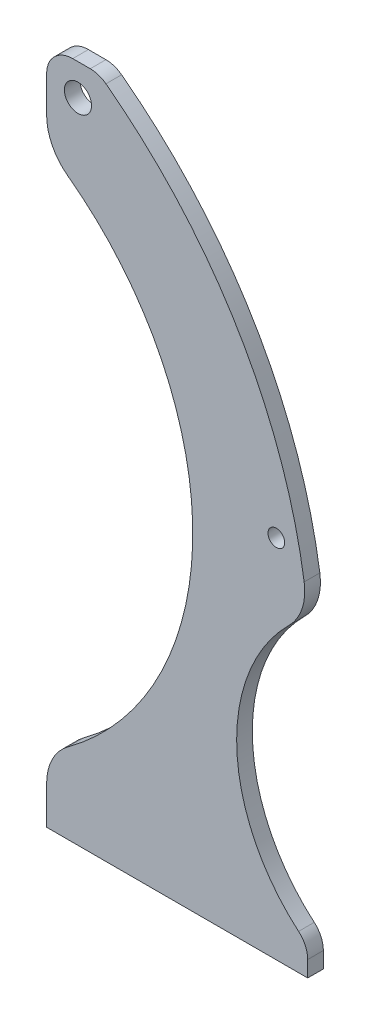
ISO-10303-21;
HEADER;
FILE_DESCRIPTION(('STEP AP214'),'2;1');
FILE_NAME('part.step','',(''),(''),'','','');
FILE_SCHEMA(('AUTOMOTIVE_DESIGN { 1 0 10303 214 1 1 1 1 }'));
ENDSEC;
DATA;
#1=APPLICATION_CONTEXT('core data for automotive mechanical design processes');
#2=APPLICATION_PROTOCOL_DEFINITION('international standard','automotive_design',2000,#1);
#3=PRODUCT_CONTEXT('',#1,'mechanical');
#4=PRODUCT('Part','Part','',(#3));
#5=PRODUCT_RELATED_PRODUCT_CATEGORY('part','',(#4));
#6=PRODUCT_DEFINITION_FORMATION('','',#4);
#7=PRODUCT_DEFINITION_CONTEXT('part definition',#1,'design');
#8=PRODUCT_DEFINITION('design','',#6,#7);
#9=PRODUCT_DEFINITION_SHAPE('','',#8);
#10=(LENGTH_UNIT() NAMED_UNIT(*) SI_UNIT(.MILLI.,.METRE.));
#11=(NAMED_UNIT(*) PLANE_ANGLE_UNIT() SI_UNIT($,.RADIAN.));
#12=(NAMED_UNIT(*) SI_UNIT($,.STERADIAN.) SOLID_ANGLE_UNIT());
#13=UNCERTAINTY_MEASURE_WITH_UNIT(LENGTH_MEASURE(1.E-05),#10,'distance_accuracy_value','');
#14=(GEOMETRIC_REPRESENTATION_CONTEXT(3) GLOBAL_UNCERTAINTY_ASSIGNED_CONTEXT((#13)) GLOBAL_UNIT_ASSIGNED_CONTEXT((#10,
#11,#12)) REPRESENTATION_CONTEXT('',''));
#15=CARTESIAN_POINT('',(0.,0.,0.));
#16=DIRECTION('',(0.,0.,1.));
#17=DIRECTION('',(1.,0.,0.));
#18=AXIS2_PLACEMENT_3D('',#15,#16,#17);
#19=CARTESIAN_POINT('',(22.062235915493,53.975,3.));
#20=DIRECTION('',(-1.,0.,0.));
#21=DIRECTION('',(0.,-1.,0.));
#22=AXIS2_PLACEMENT_3D('',#19,#20,#21);
#23=PLANE('',#22);
#24=DIRECTION('',(0.,1.,0.));
#25=VECTOR('',#24,1.);
#26=CARTESIAN_POINT('',(22.062235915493,53.975,0.));
#27=LINE('',#26,#25);
#28=CARTESIAN_POINT('',(22.062235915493,-76.025,0.));
#29=VERTEX_POINT('',#28);
#30=CARTESIAN_POINT('',(22.062235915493,-72.9630040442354,0.));
#31=VERTEX_POINT('',#30);
#32=EDGE_CURVE('E148',#29,#31,#27,.T.);
#33=ORIENTED_EDGE('',*,*,#32,.T.);
#34=DIRECTION('',(0.,0.,1.));
#35=VECTOR('',#34,1.);
#36=CARTESIAN_POINT('',(22.062235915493,-72.9630040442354,3.));
#37=LINE('',#36,#35);
#38=CARTESIAN_POINT('',(22.062235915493,-72.9630040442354,3.));
#39=VERTEX_POINT('',#38);
#40=EDGE_CURVE('E205',#31,#39,#37,.T.);
#41=ORIENTED_EDGE('',*,*,#40,.T.);
#42=DIRECTION('',(0.,1.,0.));
#43=VECTOR('',#42,1.);
#44=CARTESIAN_POINT('',(22.062235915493,53.975,3.));
#45=LINE('',#44,#43);
#46=CARTESIAN_POINT('',(22.062235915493,-76.025,3.));
#47=VERTEX_POINT('',#46);
#48=EDGE_CURVE('E262',#47,#39,#45,.T.);
#49=ORIENTED_EDGE('',*,*,#48,.F.);
#50=DIRECTION('',(0.,0.,-1.));
#51=VECTOR('',#50,1.);
#52=CARTESIAN_POINT('',(22.062235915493,-76.025,3.));
#53=LINE('',#52,#51);
#54=EDGE_CURVE('E157',#47,#29,#53,.T.);
#55=ORIENTED_EDGE('',*,*,#54,.T.);
#56=EDGE_LOOP('',(#33,#41,#49,#55));
#57=FACE_BOUND('',#56,.T.);
#58=ADVANCED_FACE('F31',(#57),#23,.F.);
#59=CARTESIAN_POINT('',(-27.937764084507,53.975,3.));
#60=DIRECTION('',(1.,0.,0.));
#61=DIRECTION('',(0.,1.,0.));
#62=AXIS2_PLACEMENT_3D('',#59,#60,#61);
#63=PLANE('',#62);
#64=DIRECTION('',(0.,-1.,0.));
#65=VECTOR('',#64,1.);
#66=CARTESIAN_POINT('',(-27.937764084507,53.975,3.));
#67=LINE('',#66,#65);
#68=CARTESIAN_POINT('',(-27.937764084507,48.975,3.));
#69=VERTEX_POINT('',#68);
#70=CARTESIAN_POINT('',(-27.937764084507,42.0916572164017,3.));
#71=VERTEX_POINT('',#70);
#72=EDGE_CURVE('E259',#69,#71,#67,.T.);
#73=ORIENTED_EDGE('',*,*,#72,.F.);
#74=DIRECTION('',(0.,0.,-1.));
#75=VECTOR('',#74,1.);
#76=CARTESIAN_POINT('',(-27.937764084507,48.975,3.));
#77=LINE('',#76,#75);
#78=CARTESIAN_POINT('',(-27.937764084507,48.975,0.));
#79=VERTEX_POINT('',#78);
#80=EDGE_CURVE('E11',#69,#79,#77,.T.);
#81=ORIENTED_EDGE('',*,*,#80,.T.);
#82=DIRECTION('',(0.,-1.,0.));
#83=VECTOR('',#82,1.);
#84=CARTESIAN_POINT('',(-27.937764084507,53.975,0.));
#85=LINE('',#84,#83);
#86=CARTESIAN_POINT('',(-27.937764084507,42.0916572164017,0.));
#87=VERTEX_POINT('',#86);
#88=EDGE_CURVE('E140',#79,#87,#85,.T.);
#89=ORIENTED_EDGE('',*,*,#88,.T.);
#90=DIRECTION('',(0.,0.,1.));
#91=VECTOR('',#90,1.);
#92=CARTESIAN_POINT('',(-27.937764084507,42.0916572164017,3.));
#93=LINE('',#92,#91);
#94=EDGE_CURVE('E196',#87,#71,#93,.T.);
#95=ORIENTED_EDGE('',*,*,#94,.T.);
#96=EDGE_LOOP('',(#73,#81,#89,#95));
#97=FACE_BOUND('',#96,.T.);
#98=ADVANCED_FACE('F269',(#97),#63,.F.);
#99=CARTESIAN_POINT('',(-27.937764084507,-68.7140359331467,3.));
#100=VERTEX_POINT('',#99);
#101=CARTESIAN_POINT('',(-27.937764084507,-76.025,3.));
#102=VERTEX_POINT('',#101);
#103=EDGE_CURVE('E232',#100,#102,#67,.T.);
#104=ORIENTED_EDGE('',*,*,#103,.F.);
#105=DIRECTION('',(0.,0.,1.));
#106=VECTOR('',#105,1.);
#107=CARTESIAN_POINT('',(-27.937764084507,-68.7140359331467,3.));
#108=LINE('',#107,#106);
#109=CARTESIAN_POINT('',(-27.937764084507,-68.7140359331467,0.));
#110=VERTEX_POINT('',#109);
#111=EDGE_CURVE('E138',#100,#110,#108,.F.);
#112=ORIENTED_EDGE('',*,*,#111,.T.);
#113=CARTESIAN_POINT('',(-27.937764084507,-76.025,0.));
#114=VERTEX_POINT('',#113);
#115=EDGE_CURVE('E132',#110,#114,#85,.T.);
#116=ORIENTED_EDGE('',*,*,#115,.T.);
#117=DIRECTION('',(0.,0.,-1.));
#118=VECTOR('',#117,1.);
#119=CARTESIAN_POINT('',(-27.937764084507,-76.025,3.));
#120=LINE('',#119,#118);
#121=EDGE_CURVE('E136',#102,#114,#120,.T.);
#122=ORIENTED_EDGE('',*,*,#121,.F.);
#123=EDGE_LOOP('',(#104,#112,#116,#122));
#124=FACE_BOUND('',#123,.T.);
#125=ADVANCED_FACE('F33',(#124),#63,.F.);
#126=CARTESIAN_POINT('',(-27.937764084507,-76.025,3.));
#127=DIRECTION('',(0.,1.,0.));
#128=DIRECTION('',(0.,0.,1.));
#129=AXIS2_PLACEMENT_3D('',#126,#127,#128);
#130=PLANE('',#129);
#131=DIRECTION('',(1.,0.,0.));
#132=VECTOR('',#131,1.);
#133=CARTESIAN_POINT('',(-27.937764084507,-76.025,0.));
#134=LINE('',#133,#132);
#135=EDGE_CURVE('E144',#114,#29,#134,.T.);
#136=ORIENTED_EDGE('',*,*,#135,.T.);
#137=ORIENTED_EDGE('',*,*,#54,.F.);
#138=DIRECTION('',(1.,0.,0.));
#139=VECTOR('',#138,1.);
#140=CARTESIAN_POINT('',(-27.937764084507,-76.025,3.));
#141=LINE('',#140,#139);
#142=EDGE_CURVE('E155',#102,#47,#141,.T.);
#143=ORIENTED_EDGE('',*,*,#142,.F.);
#144=ORIENTED_EDGE('',*,*,#121,.T.);
#145=EDGE_LOOP('',(#136,#137,#143,#144));
#146=FACE_BOUND('',#145,.T.);
#147=ADVANCED_FACE('F154',(#146),#130,.F.);
#148=CARTESIAN_POINT('',(-27.937764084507,53.975,3.));
#149=DIRECTION('',(0.,-1.,0.));
#150=DIRECTION('',(0.,0.,-1.));
#151=AXIS2_PLACEMENT_3D('',#148,#149,#150);
#152=PLANE('',#151);
#153=DIRECTION('',(-1.,0.,0.));
#154=VECTOR('',#153,1.);
#155=CARTESIAN_POINT('',(-27.937764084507,53.975,3.));
#156=LINE('',#155,#154);
#157=CARTESIAN_POINT('',(-19.5825176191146,53.975,3.));
#158=VERTEX_POINT('',#157);
#159=CARTESIAN_POINT('',(-22.937764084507,53.975,3.));
#160=VERTEX_POINT('',#159);
#161=EDGE_CURVE('E162',#158,#160,#156,.T.);
#162=ORIENTED_EDGE('',*,*,#161,.F.);
#163=DIRECTION('',(0.,0.,1.));
#164=VECTOR('',#163,1.);
#165=CARTESIAN_POINT('',(-19.5825176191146,53.975,3.));
#166=LINE('',#165,#164);
#167=CARTESIAN_POINT('',(-19.5825176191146,53.975,0.));
#168=VERTEX_POINT('',#167);
#169=EDGE_CURVE('E39',#158,#168,#166,.F.);
#170=ORIENTED_EDGE('',*,*,#169,.T.);
#171=DIRECTION('',(-1.,0.,0.));
#172=VECTOR('',#171,1.);
#173=CARTESIAN_POINT('',(-27.937764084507,53.975,0.));
#174=LINE('',#173,#172);
#175=CARTESIAN_POINT('',(-22.937764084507,53.975,0.));
#176=VERTEX_POINT('',#175);
#177=EDGE_CURVE('E228',#168,#176,#174,.T.);
#178=ORIENTED_EDGE('',*,*,#177,.T.);
#179=DIRECTION('',(0.,0.,-1.));
#180=VECTOR('',#179,1.);
#181=CARTESIAN_POINT('',(-22.937764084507,53.975,3.));
#182=LINE('',#181,#180);
#183=EDGE_CURVE('E223',#176,#160,#182,.F.);
#184=ORIENTED_EDGE('',*,*,#183,.T.);
#185=EDGE_LOOP('',(#162,#170,#178,#184));
#186=FACE_BOUND('',#185,.T.);
#187=ADVANCED_FACE('F227',(#186),#152,.F.);
#188=CARTESIAN_POINT('',(-27.937764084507,-76.025,3.));
#189=DIRECTION('',(0.,0.,1.));
#190=DIRECTION('',(1.,0.,0.));
#191=AXIS2_PLACEMENT_3D('',#188,#189,#190);
#192=PLANE('',#191);
#193=ORIENTED_EDGE('',*,*,#48,.T.);
#194=CARTESIAN_POINT('',(17.062235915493,-72.9630040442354,3.));
#195=DIRECTION('',(0.,0.,1.));
#196=DIRECTION('',(1.,0.,0.));
#197=AXIS2_PLACEMENT_3D('',#194,#195,#196);
#198=CIRCLE('',#197,5.);
#199=CARTESIAN_POINT('',(20.3144978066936,-69.1652688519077,3.));
#200=VERTEX_POINT('',#199);
#201=EDGE_CURVE('E212',#39,#200,#198,.T.);
#202=ORIENTED_EDGE('',*,*,#201,.T.);
#203=CARTESIAN_POINT('',(42.3826716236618,-43.3957942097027,3.));
#204=DIRECTION('',(0.,0.,1.));
#205=DIRECTION('',(1.,0.,0.));
#206=AXIS2_PLACEMENT_3D('',#203,#204,#205);
#207=CIRCLE('',#206,33.927424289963);
#208=CARTESIAN_POINT('',(18.5298926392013,-19.2687335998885,3.));
#209=VERTEX_POINT('',#208);
#210=EDGE_CURVE('E246',#209,#200,#207,.T.);
#211=ORIENTED_EDGE('',*,*,#210,.F.);
#212=CARTESIAN_POINT('',(11.499362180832,-12.1573595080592,3.));
#213=DIRECTION('',(0.,0.,1.));
#214=DIRECTION('',(1.,0.,0.));
#215=AXIS2_PLACEMENT_3D('',#212,#213,#214);
#216=CIRCLE('',#215,10.);
#217=CARTESIAN_POINT('',(21.3880484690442,-10.6694470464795,3.));
#218=VERTEX_POINT('',#217);
#219=EDGE_CURVE('E181',#209,#218,#216,.T.);
#220=ORIENTED_EDGE('',*,*,#219,.T.);
#221=CARTESIAN_POINT('',(-75.3284238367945,-25.2220013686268,3.));
#222=DIRECTION('',(0.,0.,-1.));
#223=DIRECTION('',(-1.,0.,0.));
#224=AXIS2_PLACEMENT_3D('',#221,#222,#223);
#225=CIRCLE('',#224,97.8051780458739);
#226=CARTESIAN_POINT('',(-16.5791342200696,52.9724602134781,3.));
#227=VERTEX_POINT('',#226);
#228=EDGE_CURVE('E239',#227,#218,#225,.T.);
#229=ORIENTED_EDGE('',*,*,#228,.F.);
#230=CARTESIAN_POINT('',(-19.5825176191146,48.975,3.));
#231=DIRECTION('',(0.,0.,1.));
#232=DIRECTION('',(1.,0.,0.));
#233=AXIS2_PLACEMENT_3D('',#230,#231,#232);
#234=CIRCLE('',#233,5.);
#235=EDGE_CURVE('E210',#227,#158,#234,.T.);
#236=ORIENTED_EDGE('',*,*,#235,.T.);
#237=ORIENTED_EDGE('',*,*,#161,.T.);
#238=CARTESIAN_POINT('',(-22.937764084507,48.975,3.));
#239=DIRECTION('',(0.,0.,1.));
#240=DIRECTION('',(1.,0.,0.));
#241=AXIS2_PLACEMENT_3D('',#238,#239,#240);
#242=CIRCLE('',#241,5.);
#243=EDGE_CURVE('E208',#160,#69,#242,.T.);
#244=ORIENTED_EDGE('',*,*,#243,.T.);
#245=ORIENTED_EDGE('',*,*,#72,.T.);
#246=CARTESIAN_POINT('',(-17.937764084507,42.0916572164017,3.));
#247=DIRECTION('',(0.,0.,1.));
#248=DIRECTION('',(1.,0.,0.));
#249=AXIS2_PLACEMENT_3D('',#246,#247,#248);
#250=CIRCLE('',#249,10.);
#251=CARTESIAN_POINT('',(-23.8712225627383,34.0421808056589,3.));
#252=VERTEX_POINT('',#251);
#253=EDGE_CURVE('E184',#71,#252,#250,.T.);
#254=ORIENTED_EDGE('',*,*,#253,.T.);
#255=CARTESIAN_POINT('',(-58.7765060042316,-13.3111893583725,3.));
#256=DIRECTION('',(0.,0.,1.));
#257=DIRECTION('',(1.,0.,0.));
#258=AXIS2_PLACEMENT_3D('',#255,#256,#257);
#259=CIRCLE('',#258,58.8278886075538);
#260=CARTESIAN_POINT('',(-23.8712225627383,-60.6645595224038,3.));
#261=VERTEX_POINT('',#260);
#262=EDGE_CURVE('E249',#261,#252,#259,.T.);
#263=ORIENTED_EDGE('',*,*,#262,.F.);
#264=CARTESIAN_POINT('',(-17.937764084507,-68.7140359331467,3.));
#265=DIRECTION('',(0.,0.,1.));
#266=DIRECTION('',(1.,0.,0.));
#267=AXIS2_PLACEMENT_3D('',#264,#265,#266);
#268=CIRCLE('',#267,10.);
#269=EDGE_CURVE('E186',#261,#100,#268,.T.);
#270=ORIENTED_EDGE('',*,*,#269,.T.);
#271=ORIENTED_EDGE('',*,*,#103,.T.);
#272=ORIENTED_EDGE('',*,*,#142,.T.);
#273=EDGE_LOOP('',(#193,#202,#211,#220,#229,#236,#237,#244,#245,#254,#263,#270,#271,#272));
#274=FACE_BOUND('',#273,.T.);
#275=CARTESIAN_POINT('',(16.062235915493,-6.025,3.));
#276=DIRECTION('',(0.,0.,1.));
#277=DIRECTION('',(1.,0.,0.));
#278=AXIS2_PLACEMENT_3D('',#275,#276,#277);
#279=CIRCLE('',#278,1.6);
#280=CARTESIAN_POINT('',(17.662235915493,-6.025,3.));
#281=VERTEX_POINT('',#280);
#282=EDGE_CURVE('E171',#281,#281,#279,.T.);
#283=ORIENTED_EDGE('',*,*,#282,.F.);
#284=EDGE_LOOP('',(#283));
#285=FACE_BOUND('',#284,.T.);
#286=CARTESIAN_POINT('',(-21.937764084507,47.975,3.));
#287=DIRECTION('',(0.,0.,1.));
#288=DIRECTION('',(1.,0.,0.));
#289=AXIS2_PLACEMENT_3D('',#286,#287,#288);
#290=CIRCLE('',#289,2.6);
#291=CARTESIAN_POINT('',(-19.337764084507,47.975,3.));
#292=VERTEX_POINT('',#291);
#293=EDGE_CURVE('E168',#292,#292,#290,.T.);
#294=ORIENTED_EDGE('',*,*,#293,.F.);
#295=EDGE_LOOP('',(#294));
#296=FACE_BOUND('',#295,.T.);
#297=ADVANCED_FACE('F242',(#274,#285,#296),#192,.T.);
#298=CARTESIAN_POINT('',(-27.937764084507,-76.025,0.));
#299=DIRECTION('',(0.,0.,1.));
#300=DIRECTION('',(1.,0.,0.));
#301=AXIS2_PLACEMENT_3D('',#298,#299,#300);
#302=PLANE('',#301);
#303=CARTESIAN_POINT('',(16.062235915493,-6.025,0.));
#304=DIRECTION('',(0.,0.,1.));
#305=DIRECTION('',(1.,0.,0.));
#306=AXIS2_PLACEMENT_3D('',#303,#304,#305);
#307=CIRCLE('',#306,1.6);
#308=CARTESIAN_POINT('',(17.662235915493,-6.025,0.));
#309=VERTEX_POINT('',#308);
#310=EDGE_CURVE('E169',#309,#309,#307,.T.);
#311=ORIENTED_EDGE('',*,*,#310,.T.);
#312=EDGE_LOOP('',(#311));
#313=FACE_BOUND('',#312,.T.);
#314=CARTESIAN_POINT('',(-21.937764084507,47.975,0.));
#315=DIRECTION('',(0.,0.,1.));
#316=DIRECTION('',(1.,0.,0.));
#317=AXIS2_PLACEMENT_3D('',#314,#315,#316);
#318=CIRCLE('',#317,2.6);
#319=CARTESIAN_POINT('',(-19.337764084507,47.975,0.));
#320=VERTEX_POINT('',#319);
#321=EDGE_CURVE('E141',#320,#320,#318,.T.);
#322=ORIENTED_EDGE('',*,*,#321,.T.);
#323=EDGE_LOOP('',(#322));
#324=FACE_BOUND('',#323,.T.);
#325=CARTESIAN_POINT('',(42.3826716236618,-43.3957942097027,0.));
#326=DIRECTION('',(0.,0.,1.));
#327=DIRECTION('',(1.,0.,0.));
#328=AXIS2_PLACEMENT_3D('',#325,#326,#327);
#329=CIRCLE('',#328,33.927424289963);
#330=CARTESIAN_POINT('',(18.5298926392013,-19.2687335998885,0.));
#331=VERTEX_POINT('',#330);
#332=CARTESIAN_POINT('',(20.3144978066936,-69.1652688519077,0.));
#333=VERTEX_POINT('',#332);
#334=EDGE_CURVE('E160',#331,#333,#329,.T.);
#335=ORIENTED_EDGE('',*,*,#334,.T.);
#336=CARTESIAN_POINT('',(17.062235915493,-72.9630040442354,0.));
#337=DIRECTION('',(0.,0.,1.));
#338=DIRECTION('',(1.,0.,0.));
#339=AXIS2_PLACEMENT_3D('',#336,#337,#338);
#340=CIRCLE('',#339,5.);
#341=EDGE_CURVE('E218',#333,#31,#340,.F.);
#342=ORIENTED_EDGE('',*,*,#341,.T.);
#343=ORIENTED_EDGE('',*,*,#32,.F.);
#344=ORIENTED_EDGE('',*,*,#135,.F.);
#345=ORIENTED_EDGE('',*,*,#115,.F.);
#346=CARTESIAN_POINT('',(-17.937764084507,-68.7140359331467,0.));
#347=DIRECTION('',(0.,0.,1.));
#348=DIRECTION('',(1.,0.,0.));
#349=AXIS2_PLACEMENT_3D('',#346,#347,#348);
#350=CIRCLE('',#349,10.);
#351=CARTESIAN_POINT('',(-23.8712225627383,-60.6645595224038,0.));
#352=VERTEX_POINT('',#351);
#353=EDGE_CURVE('E194',#110,#352,#350,.F.);
#354=ORIENTED_EDGE('',*,*,#353,.T.);
#355=CARTESIAN_POINT('',(-58.7765060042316,-13.3111893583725,0.));
#356=DIRECTION('',(0.,0.,1.));
#357=DIRECTION('',(1.,0.,0.));
#358=AXIS2_PLACEMENT_3D('',#355,#356,#357);
#359=CIRCLE('',#358,58.8278886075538);
#360=CARTESIAN_POINT('',(-23.8712225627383,34.0421808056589,0.));
#361=VERTEX_POINT('',#360);
#362=EDGE_CURVE('E156',#352,#361,#359,.T.);
#363=ORIENTED_EDGE('',*,*,#362,.T.);
#364=CARTESIAN_POINT('',(-17.937764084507,42.0916572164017,0.));
#365=DIRECTION('',(0.,0.,1.));
#366=DIRECTION('',(1.,0.,0.));
#367=AXIS2_PLACEMENT_3D('',#364,#365,#366);
#368=CIRCLE('',#367,10.);
#369=EDGE_CURVE('E191',#361,#87,#368,.F.);
#370=ORIENTED_EDGE('',*,*,#369,.T.);
#371=ORIENTED_EDGE('',*,*,#88,.F.);
#372=CARTESIAN_POINT('',(-22.937764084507,48.975,0.));
#373=DIRECTION('',(0.,0.,1.));
#374=DIRECTION('',(1.,0.,0.));
#375=AXIS2_PLACEMENT_3D('',#372,#373,#374);
#376=CIRCLE('',#375,5.);
#377=EDGE_CURVE('E52',#79,#176,#376,.F.);
#378=ORIENTED_EDGE('',*,*,#377,.T.);
#379=ORIENTED_EDGE('',*,*,#177,.F.);
#380=CARTESIAN_POINT('',(-19.5825176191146,48.975,0.));
#381=DIRECTION('',(0.,0.,1.));
#382=DIRECTION('',(1.,0.,0.));
#383=AXIS2_PLACEMENT_3D('',#380,#381,#382);
#384=CIRCLE('',#383,5.);
#385=CARTESIAN_POINT('',(-16.5791342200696,52.9724602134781,0.));
#386=VERTEX_POINT('',#385);
#387=EDGE_CURVE('E46',#168,#386,#384,.F.);
#388=ORIENTED_EDGE('',*,*,#387,.T.);
#389=CARTESIAN_POINT('',(-75.3284238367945,-25.2220013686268,0.));
#390=DIRECTION('',(0.,0.,1.));
#391=DIRECTION('',(1.,0.,0.));
#392=AXIS2_PLACEMENT_3D('',#389,#390,#391);
#393=CIRCLE('',#392,97.8051780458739);
#394=CARTESIAN_POINT('',(21.3880484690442,-10.6694470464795,0.));
#395=VERTEX_POINT('',#394);
#396=EDGE_CURVE('E174',#386,#395,#393,.F.);
#397=ORIENTED_EDGE('',*,*,#396,.T.);
#398=CARTESIAN_POINT('',(11.499362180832,-12.1573595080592,0.));
#399=DIRECTION('',(0.,0.,1.));
#400=DIRECTION('',(1.,0.,0.));
#401=AXIS2_PLACEMENT_3D('',#398,#399,#400);
#402=CIRCLE('',#401,10.);
#403=EDGE_CURVE('E189',#395,#331,#402,.F.);
#404=ORIENTED_EDGE('',*,*,#403,.T.);
#405=EDGE_LOOP('',(#335,#342,#343,#344,#345,#354,#363,#370,#371,#378,#379,#388,#397,#404));
#406=FACE_BOUND('',#405,.T.);
#407=ADVANCED_FACE('F146',(#313,#324,#406),#302,.F.);
#408=CARTESIAN_POINT('',(-21.937764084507,47.975,-3.));
#409=DIRECTION('',(0.,0.,1.));
#410=DIRECTION('',(1.,0.,0.));
#411=AXIS2_PLACEMENT_3D('',#408,#409,#410);
#412=CYLINDRICAL_SURFACE('',#411,2.6);
#413=ORIENTED_EDGE('',*,*,#293,.T.);
#414=EDGE_LOOP('',(#413));
#415=FACE_BOUND('',#414,.T.);
#416=ORIENTED_EDGE('',*,*,#321,.F.);
#417=EDGE_LOOP('',(#416));
#418=FACE_BOUND('',#417,.T.);
#419=ADVANCED_FACE('F376',(#415,#418),#412,.F.);
#420=CARTESIAN_POINT('',(16.062235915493,-6.025,-3.));
#421=DIRECTION('',(0.,0.,1.));
#422=DIRECTION('',(1.,0.,0.));
#423=AXIS2_PLACEMENT_3D('',#420,#421,#422);
#424=CYLINDRICAL_SURFACE('',#423,1.6);
#425=ORIENTED_EDGE('',*,*,#282,.T.);
#426=EDGE_LOOP('',(#425));
#427=FACE_BOUND('',#426,.T.);
#428=ORIENTED_EDGE('',*,*,#310,.F.);
#429=EDGE_LOOP('',(#428));
#430=FACE_BOUND('',#429,.T.);
#431=ADVANCED_FACE('F324',(#427,#430),#424,.F.);
#432=CARTESIAN_POINT('',(-58.7765060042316,-13.3111893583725,-17.));
#433=DIRECTION('',(0.,0.,1.));
#434=DIRECTION('',(1.,0.,0.));
#435=AXIS2_PLACEMENT_3D('',#432,#433,#434);
#436=CYLINDRICAL_SURFACE('',#435,58.8278886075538);
#437=ORIENTED_EDGE('',*,*,#362,.F.);
#438=DIRECTION('',(0.,0.,1.));
#439=VECTOR('',#438,1.);
#440=CARTESIAN_POINT('',(-23.8712225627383,-60.6645595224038,-17.));
#441=LINE('',#440,#439);
#442=EDGE_CURVE('E178',#352,#261,#441,.T.);
#443=ORIENTED_EDGE('',*,*,#442,.T.);
#444=ORIENTED_EDGE('',*,*,#262,.T.);
#445=DIRECTION('',(0.,0.,1.));
#446=VECTOR('',#445,1.);
#447=CARTESIAN_POINT('',(-23.8712225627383,34.0421808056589,-17.));
#448=LINE('',#447,#446);
#449=EDGE_CURVE('E176',#252,#361,#448,.F.);
#450=ORIENTED_EDGE('',*,*,#449,.T.);
#451=EDGE_LOOP('',(#437,#443,#444,#450));
#452=FACE_BOUND('',#451,.T.);
#453=ADVANCED_FACE('F279',(#452),#436,.F.);
#454=CARTESIAN_POINT('',(-75.3284238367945,-25.2220013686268,-17.));
#455=DIRECTION('',(0.,0.,1.));
#456=DIRECTION('',(1.,0.,0.));
#457=AXIS2_PLACEMENT_3D('',#454,#455,#456);
#458=CYLINDRICAL_SURFACE('',#457,97.8051780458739);
#459=ORIENTED_EDGE('',*,*,#396,.F.);
#460=DIRECTION('',(0.,0.,1.));
#461=VECTOR('',#460,1.);
#462=CARTESIAN_POINT('',(-16.5791342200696,52.9724602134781,-17.));
#463=LINE('',#462,#461);
#464=EDGE_CURVE('E220',#386,#227,#463,.T.);
#465=ORIENTED_EDGE('',*,*,#464,.T.);
#466=ORIENTED_EDGE('',*,*,#228,.T.);
#467=DIRECTION('',(0.,0.,1.));
#468=VECTOR('',#467,1.);
#469=CARTESIAN_POINT('',(21.3880484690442,-10.6694470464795,-17.));
#470=LINE('',#469,#468);
#471=EDGE_CURVE('E202',#218,#395,#470,.F.);
#472=ORIENTED_EDGE('',*,*,#471,.T.);
#473=EDGE_LOOP('',(#459,#465,#466,#472));
#474=FACE_BOUND('',#473,.T.);
#475=ADVANCED_FACE('F238',(#474),#458,.T.);
#476=CARTESIAN_POINT('',(42.3826716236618,-43.3957942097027,-17.));
#477=DIRECTION('',(0.,0.,1.));
#478=DIRECTION('',(1.,0.,0.));
#479=AXIS2_PLACEMENT_3D('',#476,#477,#478);
#480=CYLINDRICAL_SURFACE('',#479,33.927424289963);
#481=ORIENTED_EDGE('',*,*,#210,.T.);
#482=DIRECTION('',(0.,0.,1.));
#483=VECTOR('',#482,1.);
#484=CARTESIAN_POINT('',(20.3144978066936,-69.1652688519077,-17.));
#485=LINE('',#484,#483);
#486=EDGE_CURVE('E214',#200,#333,#485,.F.);
#487=ORIENTED_EDGE('',*,*,#486,.T.);
#488=ORIENTED_EDGE('',*,*,#334,.F.);
#489=DIRECTION('',(0.,0.,1.));
#490=VECTOR('',#489,1.);
#491=CARTESIAN_POINT('',(18.5298926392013,-19.2687335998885,-17.));
#492=LINE('',#491,#490);
#493=EDGE_CURVE('E199',#331,#209,#492,.T.);
#494=ORIENTED_EDGE('',*,*,#493,.T.);
#495=EDGE_LOOP('',(#481,#487,#488,#494));
#496=FACE_BOUND('',#495,.T.);
#497=ADVANCED_FACE('F291',(#496),#480,.F.);
#498=CARTESIAN_POINT('',(-17.937764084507,-68.7140359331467,-17.));
#499=DIRECTION('',(0.,0.,1.));
#500=DIRECTION('',(1.,0.,0.));
#501=AXIS2_PLACEMENT_3D('',#498,#499,#500);
#502=CYLINDRICAL_SURFACE('',#501,10.);
#503=ORIENTED_EDGE('',*,*,#353,.F.);
#504=ORIENTED_EDGE('',*,*,#111,.F.);
#505=ORIENTED_EDGE('',*,*,#269,.F.);
#506=ORIENTED_EDGE('',*,*,#442,.F.);
#507=EDGE_LOOP('',(#503,#504,#505,#506));
#508=FACE_BOUND('',#507,.T.);
#509=ADVANCED_FACE('F282',(#508),#502,.T.);
#510=CARTESIAN_POINT('',(-17.937764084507,42.0916572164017,-17.));
#511=DIRECTION('',(0.,0.,1.));
#512=DIRECTION('',(1.,0.,0.));
#513=AXIS2_PLACEMENT_3D('',#510,#511,#512);
#514=CYLINDRICAL_SURFACE('',#513,10.);
#515=ORIENTED_EDGE('',*,*,#369,.F.);
#516=ORIENTED_EDGE('',*,*,#449,.F.);
#517=ORIENTED_EDGE('',*,*,#253,.F.);
#518=ORIENTED_EDGE('',*,*,#94,.F.);
#519=EDGE_LOOP('',(#515,#516,#517,#518));
#520=FACE_BOUND('',#519,.T.);
#521=ADVANCED_FACE('F276',(#520),#514,.T.);
#522=CARTESIAN_POINT('',(11.499362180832,-12.1573595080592,-17.));
#523=DIRECTION('',(0.,0.,-1.));
#524=DIRECTION('',(-1.,0.,0.));
#525=AXIS2_PLACEMENT_3D('',#522,#523,#524);
#526=CYLINDRICAL_SURFACE('',#525,10.);
#527=ORIENTED_EDGE('',*,*,#403,.F.);
#528=ORIENTED_EDGE('',*,*,#471,.F.);
#529=ORIENTED_EDGE('',*,*,#219,.F.);
#530=ORIENTED_EDGE('',*,*,#493,.F.);
#531=EDGE_LOOP('',(#527,#528,#529,#530));
#532=FACE_BOUND('',#531,.T.);
#533=ADVANCED_FACE('F296',(#532),#526,.T.);
#534=CARTESIAN_POINT('',(17.062235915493,-72.9630040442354,-17.));
#535=DIRECTION('',(0.,0.,1.));
#536=DIRECTION('',(1.,0.,0.));
#537=AXIS2_PLACEMENT_3D('',#534,#535,#536);
#538=CYLINDRICAL_SURFACE('',#537,5.);
#539=ORIENTED_EDGE('',*,*,#341,.F.);
#540=ORIENTED_EDGE('',*,*,#486,.F.);
#541=ORIENTED_EDGE('',*,*,#201,.F.);
#542=ORIENTED_EDGE('',*,*,#40,.F.);
#543=EDGE_LOOP('',(#539,#540,#541,#542));
#544=FACE_BOUND('',#543,.T.);
#545=ADVANCED_FACE('F288',(#544),#538,.T.);
#546=CARTESIAN_POINT('',(-19.5825176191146,48.975,-17.));
#547=DIRECTION('',(0.,0.,1.));
#548=DIRECTION('',(1.,0.,0.));
#549=AXIS2_PLACEMENT_3D('',#546,#547,#548);
#550=CYLINDRICAL_SURFACE('',#549,5.);
#551=ORIENTED_EDGE('',*,*,#387,.F.);
#552=ORIENTED_EDGE('',*,*,#169,.F.);
#553=ORIENTED_EDGE('',*,*,#235,.F.);
#554=ORIENTED_EDGE('',*,*,#464,.F.);
#555=EDGE_LOOP('',(#551,#552,#553,#554));
#556=FACE_BOUND('',#555,.T.);
#557=ADVANCED_FACE('F235',(#556),#550,.T.);
#558=CARTESIAN_POINT('',(-22.937764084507,48.975,3.));
#559=DIRECTION('',(0.,0.,-1.));
#560=DIRECTION('',(-1.,0.,0.));
#561=AXIS2_PLACEMENT_3D('',#558,#559,#560);
#562=CYLINDRICAL_SURFACE('',#561,5.);
#563=ORIENTED_EDGE('',*,*,#243,.F.);
#564=ORIENTED_EDGE('',*,*,#183,.F.);
#565=ORIENTED_EDGE('',*,*,#377,.F.);
#566=ORIENTED_EDGE('',*,*,#80,.F.);
#567=EDGE_LOOP('',(#563,#564,#565,#566));
#568=FACE_BOUND('',#567,.T.);
#569=ADVANCED_FACE('F267',(#568),#562,.T.);
#570=CLOSED_SHELL('',(#58,#98,#125,#147,#187,#297,#407,#419,#431,#453,#475,#497,#509,#521,#533,
#545,#557,#569));
#571=MANIFOLD_SOLID_BREP('B2',#570);
#572=ADVANCED_BREP_SHAPE_REPRESENTATION('',(#18,#571),#14);
#573=SHAPE_DEFINITION_REPRESENTATION(#9,#572);
ENDSEC;
END-ISO-10303-21;
